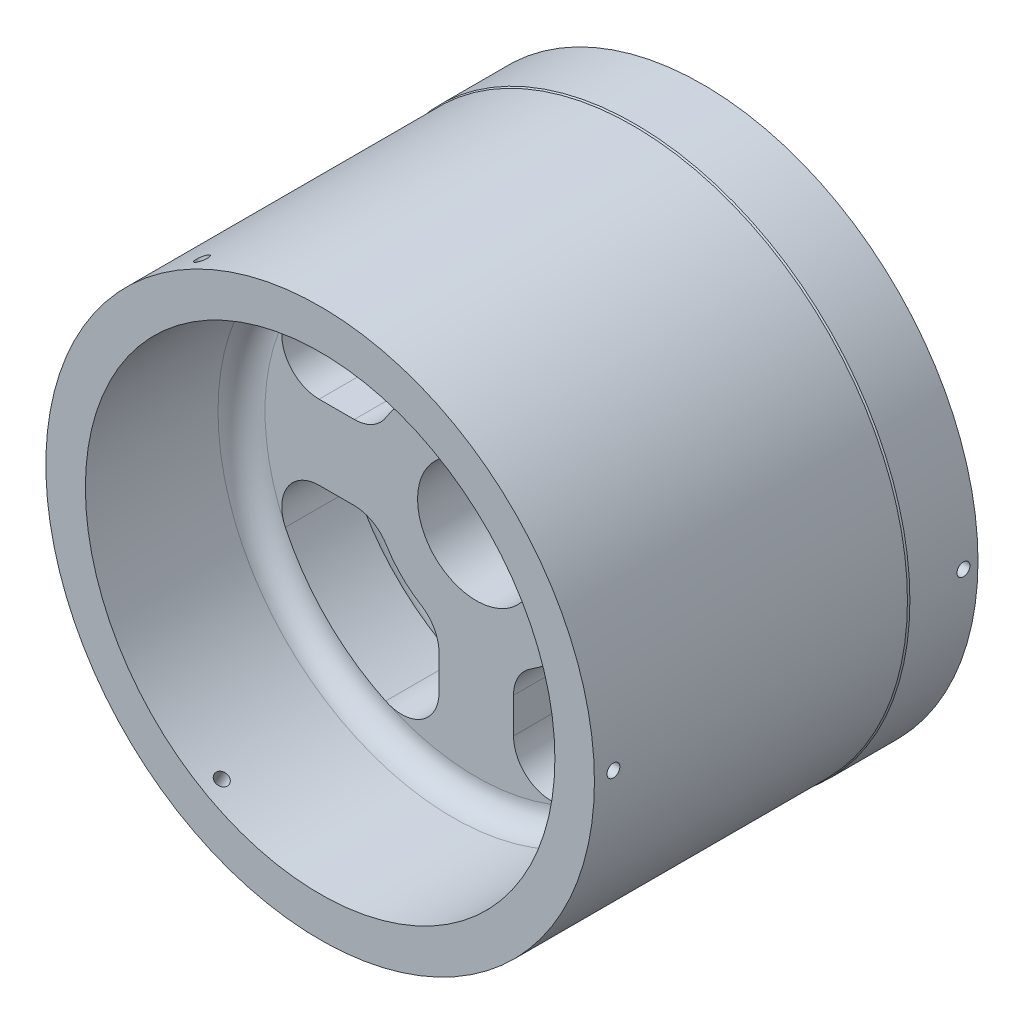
from build123d import *

# Parameters (mm, degrees)
CUT_EXTRUDE1_DEPTH = 47.497336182
CIRPATTERN1_COUNT  = 4
SKETCH16_R         = 5
SHAFT_BORE_DEPTH   = 47.762381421
CHAMFER4_SIZE      = 0.2
CIRPATTERN2_COUNT  = 2
CIRPATTERN3_COUNT  = 3


with BuildPart() as part:
    # Sketch1 → Revolve1 (revolve)
    with BuildSketch(Plane(origin=(0, 0, 0), x_dir=(0, 0, -1), z_dir=(1, 0, 0)), mode=Mode.PRIVATE) as revolve1_sk:
        with BuildLine():
            Line((-0.376932, 20), (-0.376932, 23.444))
            Line((-0.376932, 23.444), (-6.178292, 23.444))
            Line((-6.178292, 23.444), (-6.31134876, 23.368))
            Line((-6.31134876, 23.368), (-32.976932, 23.368))
            Line((-32.976932, 23.368), (-32.976932, 20))
            Line((-32.976932, 20), (-21.676932, 20))
            ThreePointArc((-21.676932, 20), (-20.262718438, 19.414213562), (-19.676932, 18))
            Line((-19.676932, 18), (-19.676932, 0))
            Line((-19.676932, 0), (-13.676932, 0))
            Line((-13.676932, 0), (-13.676932, 18))
            ThreePointArc((-13.676932, 18), (-13.091145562, 19.414213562), (-11.676932, 20))
            Line((-11.676932, 20), (-0.376932, 20))
        make_face()
    revolve(revolve1_sk.sketch.rotate(Axis((0, 0, 0), (0, 0, -1)), 90), axis=Axis((0, 0, 0), (0, 0, -1)))

    # Sketch4 → Cut-Extrude1 (cut, through all)
    with BuildSketch(Plane(origin=(0, 0, 0.376932), x_dir=(-1, 0, 0), z_dir=(0, 0, -1))):
        with BuildLine():
            Line((3.175, 10.390686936), (3.175, 13.38829246))
            ThreePointArc((3.175, 13.38829246), (4.655576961, 16.076109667), (7.718623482, 16.26108396))
            ThreePointArc((7.718623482, 16.26108396), (12.727922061, 12.727922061), (16.26108396, 7.718623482))
            ThreePointArc((16.26108396, 7.718623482), (16.076109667, 4.655576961), (13.38829246, 3.175))
            Line((13.38829246, 3.175), (10.390686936, 3.175))
            ThreePointArc((10.390686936, 3.175), (8.835665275, 3.581138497), (7.67784749, 4.695812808))
            ThreePointArc((7.67784749, 4.695812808), (6.363961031, 6.363961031), (4.695812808, 7.67784749))
            ThreePointArc((4.695812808, 7.67784749), (3.581138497, 8.835665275), (3.175, 10.390686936))
        make_face()
    cut_extrude1 = extrude(amount=-CUT_EXTRUDE1_DEPTH, mode=Mode.SUBTRACT)

    # CirPattern1: Cut-Extrude1 ×4 about axis
    cirpattern1_axis = Axis((0, 0, 0), (0, 0, 1))
    for i in range(1, CIRPATTERN1_COUNT):
        add(cut_extrude1.rotate(cirpattern1_axis, i * 360 / CIRPATTERN1_COUNT), mode=Mode.SUBTRACT)

    # Sketch16 → Shaft Bore (cut, through all)
    with BuildSketch(Plane.XY):
        with Locations(Location((0, 0, 0), (0, 0, 180))):
            Circle(SKETCH16_R)
    extrude(amount=SHAFT_BORE_DEPTH, mode=Mode.SUBTRACT)

    # Chamfer4
    chamfer4_edges = [part.edges().sort_by_distance(p)[0] for p in [
        (5, 0, 13.676932),
    ]]
    chamfer(chamfer4_edges, length=CHAMFER4_SIZE)

    # Sketch17 → M1.4x0.3 Tapped Hole1 (revolve, cut)
    with BuildSketch(Plane(origin=(23.444, 0, 1.616352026), x_dir=(0, 0, -1), z_dir=(0, 1, 0))):
        Polygon((0, 0), (0, 4.33047334), (0.55, 4), (0.55, 0), align=None)
    m1_4x0_3_tapped_hole1 = revolve(axis=Axis((29.794, 0, 1.616352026), (-1, 0, 0)), mode=Mode.SUBTRACT)

    # CirPattern2: M1.4x0.3 Tapped Hole1 ×2 about axis
    cirpattern2_axis = Axis((0, 0, 0), (0, 0, 1))
    for i in range(1, CIRPATTERN2_COUNT):
        add(m1_4x0_3_tapped_hole1.rotate(cirpattern2_axis, i * 360 / CIRPATTERN2_COUNT), mode=Mode.SUBTRACT)

    # Sketch18 → M1.4x0.3 Tapped Hole2 (revolve, cut)
    with BuildSketch(Plane(origin=(23.368, 0, 31.359712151), x_dir=(0, 0, -1), z_dir=(0, 1, 0))):
        Polygon((0, 0), (0, 4.33047334), (0.55, 4), (0.55, 0), align=None)
    m1_4x0_3_tapped_hole2 = revolve(axis=Axis((29.718, 0, 31.359712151), (-1, 0, 0)), mode=Mode.SUBTRACT)

    # CirPattern3: M1.4x0.3 Tapped Hole2 ×3 about axis
    cirpattern3_axis = Axis((0, 0, 0), (0, 0, 1))
    for i in range(1, CIRPATTERN3_COUNT):
        add(m1_4x0_3_tapped_hole2.rotate(cirpattern3_axis, i * 360 / CIRPATTERN3_COUNT), mode=Mode.SUBTRACT)


solid = part.part
